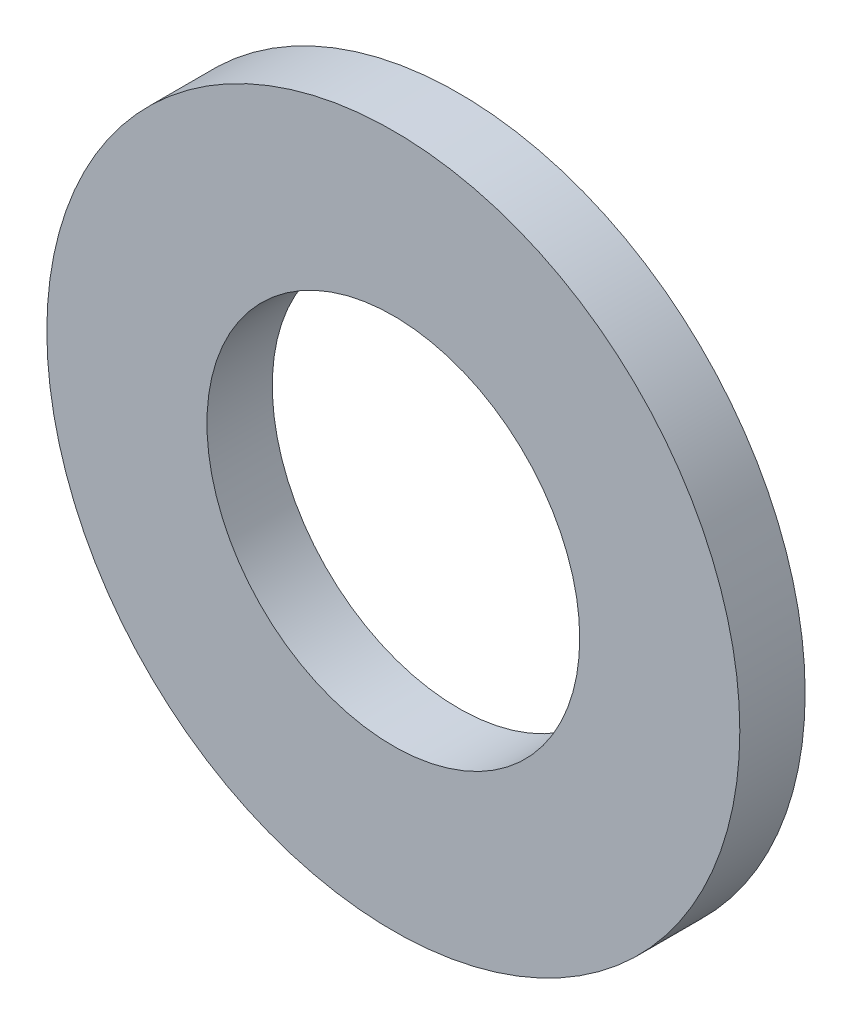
from build123d import *

# Parameters (mm, degrees)
SKETCH1_R           = 7.9
SKETCH1_R_2         = 4.25
BOSS_EXTRUDE2_DEPTH = 1.49


with BuildPart() as part:
    # Sketch1 → Boss-Extrude2 (new body)
    with BuildSketch(Plane.XY):
        Circle(SKETCH1_R)
        Circle(SKETCH1_R_2, mode=Mode.SUBTRACT)
    extrude(amount=BOSS_EXTRUDE2_DEPTH)


solid = part.part
